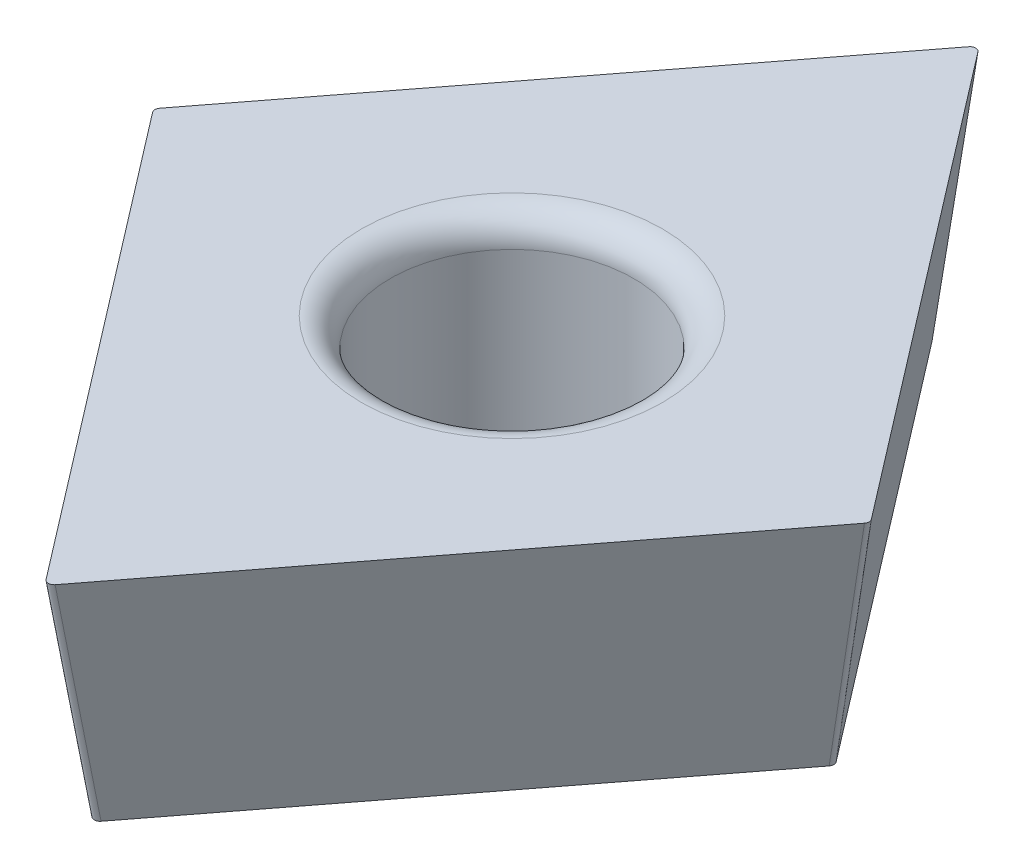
ISO-10303-21;
HEADER;
FILE_DESCRIPTION(('STEP AP214'),'2;1');
FILE_NAME('part.step','',(''),(''),'','','');
FILE_SCHEMA(('AUTOMOTIVE_DESIGN { 1 0 10303 214 1 1 1 1 }'));
ENDSEC;
DATA;
#1=APPLICATION_CONTEXT('core data for automotive mechanical design processes');
#2=APPLICATION_PROTOCOL_DEFINITION('international standard','automotive_design',2000,#1);
#3=PRODUCT_CONTEXT('',#1,'mechanical');
#4=PRODUCT('Part','Part','',(#3));
#5=PRODUCT_RELATED_PRODUCT_CATEGORY('part','',(#4));
#6=PRODUCT_DEFINITION_FORMATION('','',#4);
#7=PRODUCT_DEFINITION_CONTEXT('part definition',#1,'design');
#8=PRODUCT_DEFINITION('design','',#6,#7);
#9=PRODUCT_DEFINITION_SHAPE('','',#8);
#10=(LENGTH_UNIT() NAMED_UNIT(*) SI_UNIT(.MILLI.,.METRE.));
#11=(NAMED_UNIT(*) PLANE_ANGLE_UNIT() SI_UNIT($,.RADIAN.));
#12=(NAMED_UNIT(*) SI_UNIT($,.STERADIAN.) SOLID_ANGLE_UNIT());
#13=UNCERTAINTY_MEASURE_WITH_UNIT(LENGTH_MEASURE(1.E-05),#10,'distance_accuracy_value','');
#14=(GEOMETRIC_REPRESENTATION_CONTEXT(3) GLOBAL_UNCERTAINTY_ASSIGNED_CONTEXT((#13)) GLOBAL_UNIT_ASSIGNED_CONTEXT((#10,
#11,#12)) REPRESENTATION_CONTEXT('',''));
#15=CARTESIAN_POINT('',(0.,0.,0.));
#16=DIRECTION('',(0.,0.,1.));
#17=DIRECTION('',(1.,0.,0.));
#18=AXIS2_PLACEMENT_3D('',#15,#16,#17);
#19=CARTESIAN_POINT('',(0.,1.59,6.52143813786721));
#20=DIRECTION('',(0.787439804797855,-0.121869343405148,0.604223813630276));
#21=DIRECTION('',(0.608761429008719,0.,-0.793353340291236));
#22=AXIS2_PLACEMENT_3D('',#19,#20,#21);
#23=PLANE('',#22);
#24=DIRECTION('',(0.608761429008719,0.,-0.793353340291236));
#25=VECTOR('',#24,1.);
#26=CARTESIAN_POINT('',(2.83984405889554,-1.59,2.17908898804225));
#27=LINE('',#26,#25);
#28=CARTESIAN_POINT('',(0.0629951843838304,-1.59,5.79794889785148));
#29=VERTEX_POINT('',#28);
#30=CARTESIAN_POINT('',(4.47482686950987,-1.59,0.0483379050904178));
#31=VERTEX_POINT('',#30);
#32=EDGE_CURVE('E286',#29,#31,#27,.T.);
#33=ORIENTED_EDGE('',*,*,#32,.T.);
#34=DIRECTION('',(0.152945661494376,0.988234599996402,0.));
#35=VECTOR('',#34,1.);
#36=CARTESIAN_POINT('',(4.85079493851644,0.839259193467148,0.0483379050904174));
#37=LINE('',#36,#35);
#38=CARTESIAN_POINT('',(4.9669845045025,1.59,0.0483379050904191));
#39=VERTEX_POINT('',#38);
#40=EDGE_CURVE('E116',#31,#39,#37,.T.);
#41=ORIENTED_EDGE('',*,*,#40,.T.);
#42=DIRECTION('',(0.608761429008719,0.,-0.793353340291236));
#43=VECTOR('',#42,1.);
#44=CARTESIAN_POINT('',(0.,1.59,6.52143813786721));
#45=LINE('',#44,#43);
#46=CARTESIAN_POINT('',(0.0629951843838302,1.59,6.43934121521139));
#47=VERTEX_POINT('',#46);
#48=EDGE_CURVE('E108',#47,#39,#45,.T.);
#49=ORIENTED_EDGE('',*,*,#48,.F.);
#50=DIRECTION('',(0.,0.980259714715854,0.197714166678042));
#51=VECTOR('',#50,1.);
#52=CARTESIAN_POINT('',(0.0629951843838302,1.60591130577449,6.44255045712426));
#53=LINE('',#52,#51);
#54=EDGE_CURVE('E121',#47,#29,#53,.F.);
#55=ORIENTED_EDGE('',*,*,#54,.T.);
#56=EDGE_LOOP('',(#33,#41,#49,#55));
#57=FACE_BOUND('',#56,.T.);
#58=ADVANCED_FACE('F38',(#57),#23,.T.);
#59=CARTESIAN_POINT('',(-5.00407548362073,1.59,0.));
#60=DIRECTION('',(-0.787439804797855,-0.121869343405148,0.604223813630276));
#61=DIRECTION('',(0.608761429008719,0.,0.793353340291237));
#62=AXIS2_PLACEMENT_3D('',#59,#60,#61);
#63=PLANE('',#62);
#64=DIRECTION('',(0.608761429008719,0.,0.793353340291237));
#65=VECTOR('',#64,1.);
#66=CARTESIAN_POINT('',(-5.00407548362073,1.59,0.));
#67=LINE('',#66,#65);
#68=CARTESIAN_POINT('',(-4.96698450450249,1.59,0.0483379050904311));
#69=VERTEX_POINT('',#68);
#70=CARTESIAN_POINT('',(-0.0629951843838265,1.59,6.4393412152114));
#71=VERTEX_POINT('',#70);
#72=EDGE_CURVE('E110',#69,#71,#67,.T.);
#73=ORIENTED_EDGE('',*,*,#72,.F.);
#74=DIRECTION('',(-0.152945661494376,0.988234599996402,0.));
#75=VECTOR('',#74,1.);
#76=CARTESIAN_POINT('',(-4.96785215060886,1.59560616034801,0.048337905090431));
#77=LINE('',#76,#75);
#78=CARTESIAN_POINT('',(-4.47482686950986,-1.59,0.0483379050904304));
#79=VERTEX_POINT('',#78);
#80=EDGE_CURVE('E162',#69,#79,#77,.F.);
#81=ORIENTED_EDGE('',*,*,#80,.T.);
#82=DIRECTION('',(0.608761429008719,0.,0.793353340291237));
#83=VECTOR('',#82,1.);
#84=CARTESIAN_POINT('',(-2.83984405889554,-1.59,2.17908898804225));
#85=LINE('',#84,#83);
#86=CARTESIAN_POINT('',(-0.0629951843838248,-1.59,5.79794889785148));
#87=VERTEX_POINT('',#86);
#88=EDGE_CURVE('E130',#79,#87,#85,.T.);
#89=ORIENTED_EDGE('',*,*,#88,.T.);
#90=DIRECTION('',(0.,0.980259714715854,0.197714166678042));
#91=VECTOR('',#90,1.);
#92=CARTESIAN_POINT('',(-0.0629951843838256,0.341983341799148,6.18762162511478));
#93=LINE('',#92,#91);
#94=EDGE_CURVE('E160',#87,#71,#93,.T.);
#95=ORIENTED_EDGE('',*,*,#94,.T.);
#96=EDGE_LOOP('',(#73,#81,#89,#95));
#97=FACE_BOUND('',#96,.T.);
#98=ADVANCED_FACE('F177',(#97),#63,.T.);
#99=CARTESIAN_POINT('',(0.,1.59,-6.52143813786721));
#100=DIRECTION('',(-0.787439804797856,-0.121869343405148,-0.604223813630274));
#101=DIRECTION('',(-0.608761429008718,0.,0.793353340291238));
#102=AXIS2_PLACEMENT_3D('',#99,#100,#101);
#103=PLANE('',#102);
#104=DIRECTION('',(-0.608761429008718,0.,0.793353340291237));
#105=VECTOR('',#104,1.);
#106=CARTESIAN_POINT('',(0.,1.59,-6.52143813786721));
#107=LINE('',#106,#105);
#108=CARTESIAN_POINT('',(-0.0629951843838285,1.59,-6.43934121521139));
#109=VERTEX_POINT('',#108);
#110=CARTESIAN_POINT('',(-4.96698450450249,1.59,-0.0483379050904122));
#111=VERTEX_POINT('',#110);
#112=EDGE_CURVE('E290',#109,#111,#107,.T.);
#113=ORIENTED_EDGE('',*,*,#112,.F.);
#114=DIRECTION('',(0.,0.980259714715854,-0.197714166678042));
#115=VECTOR('',#114,1.);
#116=CARTESIAN_POINT('',(-0.0629951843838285,1.60591130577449,-6.44255045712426));
#117=LINE('',#116,#115);
#118=CARTESIAN_POINT('',(-0.0629951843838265,-1.59,-5.79794889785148));
#119=VERTEX_POINT('',#118);
#120=EDGE_CURVE('E60',#109,#119,#117,.F.);
#121=ORIENTED_EDGE('',*,*,#120,.T.);
#122=DIRECTION('',(-0.608761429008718,0.,0.793353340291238));
#123=VECTOR('',#122,1.);
#124=CARTESIAN_POINT('',(-2.83984405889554,-1.59,-2.17908898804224));
#125=LINE('',#124,#123);
#126=CARTESIAN_POINT('',(-4.47482686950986,-1.59,-0.0483379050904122));
#127=VERTEX_POINT('',#126);
#128=EDGE_CURVE('E134',#119,#127,#125,.T.);
#129=ORIENTED_EDGE('',*,*,#128,.T.);
#130=DIRECTION('',(-0.152945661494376,0.988234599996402,0.));
#131=VECTOR('',#130,1.);
#132=CARTESIAN_POINT('',(-4.85079493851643,0.83925919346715,-0.0483379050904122));
#133=LINE('',#132,#131);
#134=EDGE_CURVE('E156',#127,#111,#133,.T.);
#135=ORIENTED_EDGE('',*,*,#134,.T.);
#136=EDGE_LOOP('',(#113,#121,#129,#135));
#137=FACE_BOUND('',#136,.T.);
#138=ADVANCED_FACE('F182',(#137),#103,.T.);
#139=CARTESIAN_POINT('',(5.00407548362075,1.59,0.));
#140=DIRECTION('',(0.787439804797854,-0.121869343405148,-0.604223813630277));
#141=DIRECTION('',(-0.60876142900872,0.,-0.793353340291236));
#142=AXIS2_PLACEMENT_3D('',#139,#140,#141);
#143=PLANE('',#142);
#144=DIRECTION('',(-0.60876142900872,0.,-0.793353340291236));
#145=VECTOR('',#144,1.);
#146=CARTESIAN_POINT('',(5.00407548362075,1.59,0.));
#147=LINE('',#146,#145);
#148=CARTESIAN_POINT('',(4.9669845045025,1.59,-0.0483379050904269));
#149=VERTEX_POINT('',#148);
#150=CARTESIAN_POINT('',(0.0629951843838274,1.59,-6.4393412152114));
#151=VERTEX_POINT('',#150);
#152=EDGE_CURVE('E124',#149,#151,#147,.T.);
#153=ORIENTED_EDGE('',*,*,#152,.F.);
#154=DIRECTION('',(0.152945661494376,0.988234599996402,0.));
#155=VECTOR('',#154,1.);
#156=CARTESIAN_POINT('',(4.96785215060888,1.59560616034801,-0.0483379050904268));
#157=LINE('',#156,#155);
#158=CARTESIAN_POINT('',(4.47482686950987,-1.59,-0.0483379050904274));
#159=VERTEX_POINT('',#158);
#160=EDGE_CURVE('E148',#149,#159,#157,.F.);
#161=ORIENTED_EDGE('',*,*,#160,.T.);
#162=DIRECTION('',(-0.60876142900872,0.,-0.793353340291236));
#163=VECTOR('',#162,1.);
#164=CARTESIAN_POINT('',(2.83984405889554,-1.59,-2.17908898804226));
#165=LINE('',#164,#163);
#166=CARTESIAN_POINT('',(0.0629951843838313,-1.59,-5.79794889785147));
#167=VERTEX_POINT('',#166);
#168=EDGE_CURVE('E137',#159,#167,#165,.T.);
#169=ORIENTED_EDGE('',*,*,#168,.T.);
#170=DIRECTION('',(0.,0.980259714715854,-0.197714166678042));
#171=VECTOR('',#170,1.);
#172=CARTESIAN_POINT('',(0.0629951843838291,0.341983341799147,-6.18762162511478));
#173=LINE('',#172,#171);
#174=EDGE_CURVE('E145',#167,#151,#173,.T.);
#175=ORIENTED_EDGE('',*,*,#174,.T.);
#176=EDGE_LOOP('',(#153,#161,#169,#175));
#177=FACE_BOUND('',#176,.T.);
#178=ADVANCED_FACE('F188',(#177),#143,.T.);
#179=CARTESIAN_POINT('',(0.,-1.59,0.));
#180=DIRECTION('',(0.,1.,0.));
#181=DIRECTION('',(0.,0.,1.));
#182=AXIS2_PLACEMENT_3D('',#179,#180,#181);
#183=PLANE('',#182);
#184=CARTESIAN_POINT('',(0.,-1.59,0.));
#185=DIRECTION('',(0.,1.,0.));
#186=DIRECTION('',(0.,0.,1.));
#187=AXIS2_PLACEMENT_3D('',#184,#185,#186);
#188=CIRCLE('',#187,1.7);
#189=CARTESIAN_POINT('',(0.,-1.59,1.7));
#190=VERTEX_POINT('',#189);
#191=EDGE_CURVE('E125',#190,#190,#188,.F.);
#192=ORIENTED_EDGE('',*,*,#191,.F.);
#193=EDGE_LOOP('',(#192));
#194=FACE_BOUND('',#193,.T.);
#195=ORIENTED_EDGE('',*,*,#168,.F.);
#196=CARTESIAN_POINT('',(4.41032278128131,-1.59,0.));
#197=DIRECTION('',(0.,1.,0.));
#198=DIRECTION('',(1.,0.,0.));
#199=AXIS2_PLACEMENT_3D('',#196,#197,#198);
#200=ELLIPSE('',#199,0.0809524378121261,0.08);
#201=EDGE_CURVE('E154',#159,#31,#200,.F.);
#202=ORIENTED_EDGE('',*,*,#201,.T.);
#203=ORIENTED_EDGE('',*,*,#32,.F.);
#204=CARTESIAN_POINT('',(0.,-1.59,5.74764455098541));
#205=DIRECTION('',(0.,1.,0.));
#206=DIRECTION('',(0.,0.,1.));
#207=AXIS2_PLACEMENT_3D('',#204,#205,#206);
#208=ELLIPSE('',#207,0.0816110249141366,0.08);
#209=EDGE_CURVE('E129',#29,#87,#208,.F.);
#210=ORIENTED_EDGE('',*,*,#209,.T.);
#211=ORIENTED_EDGE('',*,*,#88,.F.);
#212=CARTESIAN_POINT('',(-4.41032278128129,-1.59,0.));
#213=DIRECTION('',(0.,1.,0.));
#214=DIRECTION('',(-1.,0.,0.));
#215=AXIS2_PLACEMENT_3D('',#212,#213,#214);
#216=ELLIPSE('',#215,0.0809524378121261,0.08);
#217=EDGE_CURVE('E53',#79,#127,#216,.F.);
#218=ORIENTED_EDGE('',*,*,#217,.T.);
#219=ORIENTED_EDGE('',*,*,#128,.F.);
#220=CARTESIAN_POINT('',(0.,-1.59,-5.74764455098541));
#221=DIRECTION('',(0.,1.,0.));
#222=DIRECTION('',(0.,0.,-1.));
#223=AXIS2_PLACEMENT_3D('',#220,#221,#222);
#224=ELLIPSE('',#223,0.0816110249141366,0.08);
#225=EDGE_CURVE('E152',#119,#167,#224,.F.);
#226=ORIENTED_EDGE('',*,*,#225,.T.);
#227=EDGE_LOOP('',(#195,#202,#203,#210,#211,#218,#219,#226));
#228=FACE_BOUND('',#227,.T.);
#229=ADVANCED_FACE('F191',(#194,#228),#183,.F.);
#230=CARTESIAN_POINT('',(0.,1.59,0.));
#231=DIRECTION('',(0.,1.,0.));
#232=DIRECTION('',(0.,0.,1.));
#233=AXIS2_PLACEMENT_3D('',#230,#231,#232);
#234=PLANE('',#233);
#235=CARTESIAN_POINT('',(0.,1.59,0.));
#236=DIRECTION('',(0.,1.,0.));
#237=DIRECTION('',(0.,0.,1.));
#238=AXIS2_PLACEMENT_3D('',#235,#236,#237);
#239=CIRCLE('',#238,2.1);
#240=CARTESIAN_POINT('',(0.,1.59,2.1));
#241=VERTEX_POINT('',#240);
#242=EDGE_CURVE('E11',#241,#241,#239,.F.);
#243=ORIENTED_EDGE('',*,*,#242,.T.);
#244=EDGE_LOOP('',(#243));
#245=FACE_BOUND('',#244,.T.);
#246=ORIENTED_EDGE('',*,*,#48,.T.);
#247=CARTESIAN_POINT('',(4.90248041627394,1.59,0.));
#248=DIRECTION('',(0.,1.,0.));
#249=DIRECTION('',(1.,0.,0.));
#250=AXIS2_PLACEMENT_3D('',#247,#248,#249);
#251=ELLIPSE('',#250,0.0809524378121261,0.08);
#252=EDGE_CURVE('E143',#39,#149,#251,.T.);
#253=ORIENTED_EDGE('',*,*,#252,.T.);
#254=ORIENTED_EDGE('',*,*,#152,.T.);
#255=CARTESIAN_POINT('',(0.,1.59,-6.38903686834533));
#256=DIRECTION('',(0.,1.,0.));
#257=DIRECTION('',(0.,0.,-1.));
#258=AXIS2_PLACEMENT_3D('',#255,#256,#257);
#259=ELLIPSE('',#258,0.0816110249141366,0.08);
#260=EDGE_CURVE('E141',#151,#109,#259,.T.);
#261=ORIENTED_EDGE('',*,*,#260,.T.);
#262=ORIENTED_EDGE('',*,*,#112,.T.);
#263=CARTESIAN_POINT('',(-4.90248041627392,1.59,0.));
#264=DIRECTION('',(0.,1.,0.));
#265=DIRECTION('',(-1.,0.,0.));
#266=AXIS2_PLACEMENT_3D('',#263,#264,#265);
#267=ELLIPSE('',#266,0.0809524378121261,0.08);
#268=EDGE_CURVE('E115',#111,#69,#267,.T.);
#269=ORIENTED_EDGE('',*,*,#268,.T.);
#270=ORIENTED_EDGE('',*,*,#72,.T.);
#271=CARTESIAN_POINT('',(0.,1.59,6.38903686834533));
#272=DIRECTION('',(0.,1.,0.));
#273=DIRECTION('',(0.,0.,1.));
#274=AXIS2_PLACEMENT_3D('',#271,#272,#273);
#275=ELLIPSE('',#274,0.0816110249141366,0.08);
#276=EDGE_CURVE('E105',#71,#47,#275,.T.);
#277=ORIENTED_EDGE('',*,*,#276,.T.);
#278=EDGE_LOOP('',(#246,#253,#254,#261,#262,#269,#270,#277));
#279=FACE_BOUND('',#278,.T.);
#280=ADVANCED_FACE('F107',(#245,#279),#234,.T.);
#281=CARTESIAN_POINT('',(4.78779975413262,0.84900874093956,0.));
#282=DIRECTION('',(0.152945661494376,0.988234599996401,0.));
#283=DIRECTION('',(-0.988234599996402,0.152945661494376,0.));
#284=AXIS2_PLACEMENT_3D('',#281,#282,#283);
#285=CYLINDRICAL_SURFACE('',#284,0.08);
#286=ORIENTED_EDGE('',*,*,#201,.F.);
#287=ORIENTED_EDGE('',*,*,#160,.F.);
#288=ORIENTED_EDGE('',*,*,#252,.F.);
#289=ORIENTED_EDGE('',*,*,#40,.F.);
#290=EDGE_LOOP('',(#286,#287,#288,#289));
#291=FACE_BOUND('',#290,.T.);
#292=ADVANCED_FACE('F195',(#291),#285,.T.);
#293=CARTESIAN_POINT('',(0.,0.351732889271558,-6.13928372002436));
#294=DIRECTION('',(0.,0.980259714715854,-0.197714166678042));
#295=DIRECTION('',(0.,0.197714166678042,0.980259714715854));
#296=AXIS2_PLACEMENT_3D('',#293,#294,#295);
#297=CYLINDRICAL_SURFACE('',#296,0.08);
#298=ORIENTED_EDGE('',*,*,#225,.F.);
#299=ORIENTED_EDGE('',*,*,#120,.F.);
#300=ORIENTED_EDGE('',*,*,#260,.F.);
#301=ORIENTED_EDGE('',*,*,#174,.F.);
#302=EDGE_LOOP('',(#298,#299,#300,#301));
#303=FACE_BOUND('',#302,.T.);
#304=ADVANCED_FACE('F198',(#303),#297,.T.);
#305=CARTESIAN_POINT('',(-4.7877997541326,0.849008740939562,0.));
#306=DIRECTION('',(-0.152945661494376,0.988234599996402,0.));
#307=DIRECTION('',(-0.988234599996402,-0.152945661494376,0.));
#308=AXIS2_PLACEMENT_3D('',#305,#306,#307);
#309=CYLINDRICAL_SURFACE('',#308,0.08);
#310=ORIENTED_EDGE('',*,*,#217,.F.);
#311=ORIENTED_EDGE('',*,*,#80,.F.);
#312=ORIENTED_EDGE('',*,*,#268,.F.);
#313=ORIENTED_EDGE('',*,*,#134,.F.);
#314=EDGE_LOOP('',(#310,#311,#312,#313));
#315=FACE_BOUND('',#314,.T.);
#316=ADVANCED_FACE('F202',(#315),#309,.T.);
#317=CARTESIAN_POINT('',(0.,0.35173288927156,6.13928372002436));
#318=DIRECTION('',(0.,0.980259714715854,0.197714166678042));
#319=DIRECTION('',(0.,-0.197714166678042,0.980259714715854));
#320=AXIS2_PLACEMENT_3D('',#317,#318,#319);
#321=CYLINDRICAL_SURFACE('',#320,0.08);
#322=ORIENTED_EDGE('',*,*,#209,.F.);
#323=ORIENTED_EDGE('',*,*,#54,.F.);
#324=ORIENTED_EDGE('',*,*,#276,.F.);
#325=ORIENTED_EDGE('',*,*,#94,.F.);
#326=EDGE_LOOP('',(#322,#323,#324,#325));
#327=FACE_BOUND('',#326,.T.);
#328=ADVANCED_FACE('F128',(#327),#321,.T.);
#329=CARTESIAN_POINT('',(0.,-1.591,0.));
#330=DIRECTION('',(0.,1.,0.));
#331=DIRECTION('',(0.,0.,1.));
#332=AXIS2_PLACEMENT_3D('',#329,#330,#331);
#333=CYLINDRICAL_SURFACE('',#332,1.7);
#334=CARTESIAN_POINT('',(0.,1.19,0.));
#335=DIRECTION('',(0.,1.,0.));
#336=DIRECTION('',(0.,0.,1.));
#337=AXIS2_PLACEMENT_3D('',#334,#335,#336);
#338=CIRCLE('',#337,1.7);
#339=CARTESIAN_POINT('',(0.,1.19,1.7));
#340=VERTEX_POINT('',#339);
#341=EDGE_CURVE('E46',#340,#340,#338,.T.);
#342=ORIENTED_EDGE('',*,*,#341,.T.);
#343=EDGE_LOOP('',(#342));
#344=FACE_BOUND('',#343,.T.);
#345=ORIENTED_EDGE('',*,*,#191,.T.);
#346=EDGE_LOOP('',(#345));
#347=FACE_BOUND('',#346,.T.);
#348=ADVANCED_FACE('F166',(#344,#347),#333,.F.);
#349=CARTESIAN_POINT('',(0.,1.19,0.));
#350=DIRECTION('',(0.,1.,0.));
#351=DIRECTION('',(0.,0.,1.));
#352=AXIS2_PLACEMENT_3D('',#349,#350,#351);
#353=TOROIDAL_SURFACE('',#352,2.1,0.4);
#354=ORIENTED_EDGE('',*,*,#242,.F.);
#355=EDGE_LOOP('',(#354));
#356=FACE_BOUND('',#355,.T.);
#357=ORIENTED_EDGE('',*,*,#341,.F.);
#358=EDGE_LOOP('',(#357));
#359=FACE_BOUND('',#358,.T.);
#360=ADVANCED_FACE('F40',(#356,#359),#353,.T.);
#361=CLOSED_SHELL('',(#58,#98,#138,#178,#229,#280,#292,#304,#316,#328,#348,#360));
#362=MANIFOLD_SOLID_BREP('B2',#361);
#363=ADVANCED_BREP_SHAPE_REPRESENTATION('',(#18,#362),#14);
#364=SHAPE_DEFINITION_REPRESENTATION(#9,#363);
ENDSEC;
END-ISO-10303-21;
